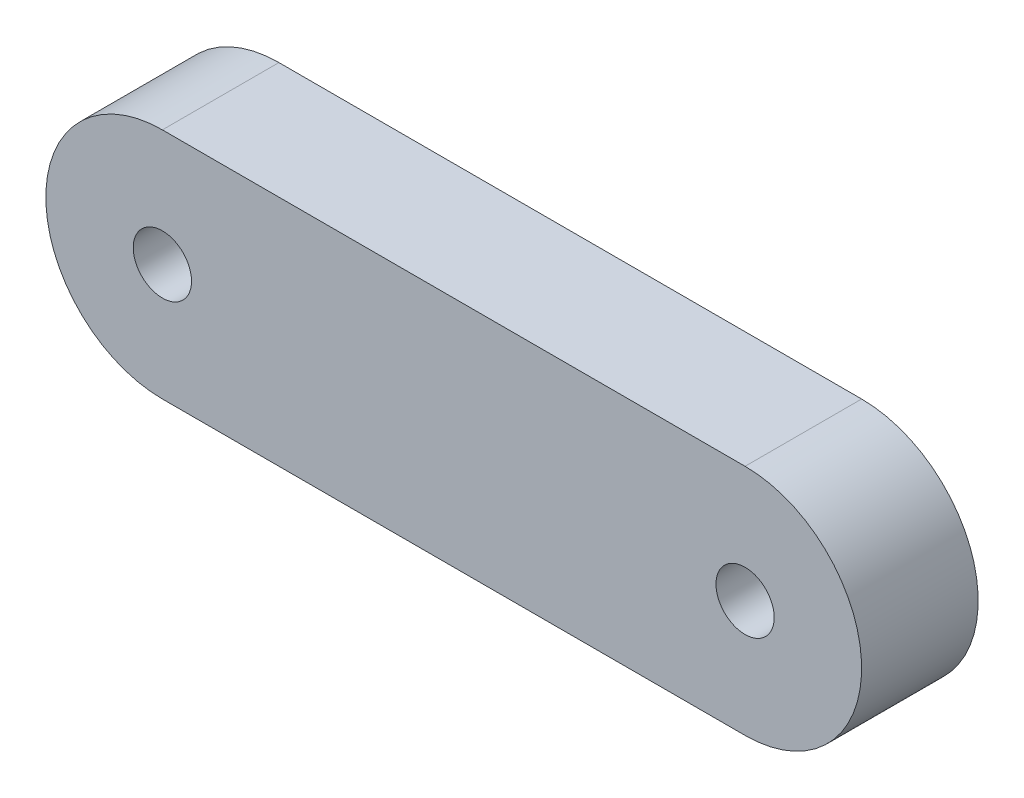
ISO-10303-21;
HEADER;
FILE_DESCRIPTION(('STEP AP214'),'2;1');
FILE_NAME('part.step','',(''),(''),'','','');
FILE_SCHEMA(('AUTOMOTIVE_DESIGN { 1 0 10303 214 1 1 1 1 }'));
ENDSEC;
DATA;
#1=APPLICATION_CONTEXT('core data for automotive mechanical design processes');
#2=APPLICATION_PROTOCOL_DEFINITION('international standard','automotive_design',2000,#1);
#3=PRODUCT_CONTEXT('',#1,'mechanical');
#4=PRODUCT('Part','Part','',(#3));
#5=PRODUCT_RELATED_PRODUCT_CATEGORY('part','',(#4));
#6=PRODUCT_DEFINITION_FORMATION('','',#4);
#7=PRODUCT_DEFINITION_CONTEXT('part definition',#1,'design');
#8=PRODUCT_DEFINITION('design','',#6,#7);
#9=PRODUCT_DEFINITION_SHAPE('','',#8);
#10=(LENGTH_UNIT() NAMED_UNIT(*) SI_UNIT(.MILLI.,.METRE.));
#11=(NAMED_UNIT(*) PLANE_ANGLE_UNIT() SI_UNIT($,.RADIAN.));
#12=(NAMED_UNIT(*) SI_UNIT($,.STERADIAN.) SOLID_ANGLE_UNIT());
#13=UNCERTAINTY_MEASURE_WITH_UNIT(LENGTH_MEASURE(1.E-05),#10,'distance_accuracy_value','');
#14=(GEOMETRIC_REPRESENTATION_CONTEXT(3) GLOBAL_UNCERTAINTY_ASSIGNED_CONTEXT((#13)) GLOBAL_UNIT_ASSIGNED_CONTEXT((#10,
#11,#12)) REPRESENTATION_CONTEXT('',''));
#15=CARTESIAN_POINT('',(0.,0.,0.));
#16=DIRECTION('',(0.,0.,1.));
#17=DIRECTION('',(1.,0.,0.));
#18=AXIS2_PLACEMENT_3D('',#15,#16,#17);
#19=CARTESIAN_POINT('',(0.,0.,2.54));
#20=DIRECTION('',(0.,0.,-1.));
#21=DIRECTION('',(-1.,0.,0.));
#22=AXIS2_PLACEMENT_3D('',#19,#20,#21);
#23=CYLINDRICAL_SURFACE('',#22,2.54);
#24=CARTESIAN_POINT('',(0.,0.,0.));
#25=DIRECTION('',(0.,0.,1.));
#26=DIRECTION('',(1.,0.,0.));
#27=AXIS2_PLACEMENT_3D('',#24,#25,#26);
#28=CIRCLE('',#27,2.54);
#29=CARTESIAN_POINT('',(0.,2.54,0.));
#30=VERTEX_POINT('',#29);
#31=CARTESIAN_POINT('',(0.,-2.54,0.));
#32=VERTEX_POINT('',#31);
#33=EDGE_CURVE('E95',#30,#32,#28,.T.);
#34=ORIENTED_EDGE('',*,*,#33,.T.);
#35=DIRECTION('',(0.,0.,-1.));
#36=VECTOR('',#35,1.);
#37=CARTESIAN_POINT('',(0.,-2.54,2.54));
#38=LINE('',#37,#36);
#39=CARTESIAN_POINT('',(0.,-2.54,2.54));
#40=VERTEX_POINT('',#39);
#41=EDGE_CURVE('E11',#40,#32,#38,.T.);
#42=ORIENTED_EDGE('',*,*,#41,.F.);
#43=CARTESIAN_POINT('',(0.,0.,2.54));
#44=DIRECTION('',(0.,0.,1.));
#45=DIRECTION('',(1.,0.,0.));
#46=AXIS2_PLACEMENT_3D('',#43,#44,#45);
#47=CIRCLE('',#46,2.54);
#48=CARTESIAN_POINT('',(0.,2.54,2.54));
#49=VERTEX_POINT('',#48);
#50=EDGE_CURVE('E83',#49,#40,#47,.T.);
#51=ORIENTED_EDGE('',*,*,#50,.F.);
#52=DIRECTION('',(0.,0.,-1.));
#53=VECTOR('',#52,1.);
#54=CARTESIAN_POINT('',(0.,2.54,2.54));
#55=LINE('',#54,#53);
#56=EDGE_CURVE('E91',#49,#30,#55,.T.);
#57=ORIENTED_EDGE('',*,*,#56,.T.);
#58=EDGE_LOOP('',(#34,#42,#51,#57));
#59=FACE_BOUND('',#58,.T.);
#60=ADVANCED_FACE('F32',(#59),#23,.T.);
#61=CARTESIAN_POINT('',(0.,-2.54,2.54));
#62=DIRECTION('',(0.,1.,0.));
#63=DIRECTION('',(0.,0.,1.));
#64=AXIS2_PLACEMENT_3D('',#61,#62,#63);
#65=PLANE('',#64);
#66=DIRECTION('',(1.,0.,0.));
#67=VECTOR('',#66,1.);
#68=CARTESIAN_POINT('',(0.,-2.54,0.));
#69=LINE('',#68,#67);
#70=CARTESIAN_POINT('',(12.7,-2.54,0.));
#71=VERTEX_POINT('',#70);
#72=EDGE_CURVE('E87',#32,#71,#69,.T.);
#73=ORIENTED_EDGE('',*,*,#72,.T.);
#74=DIRECTION('',(0.,0.,-1.));
#75=VECTOR('',#74,1.);
#76=CARTESIAN_POINT('',(12.7,-2.54,2.54));
#77=LINE('',#76,#75);
#78=CARTESIAN_POINT('',(12.7,-2.54,2.54));
#79=VERTEX_POINT('',#78);
#80=EDGE_CURVE('E40',#79,#71,#77,.T.);
#81=ORIENTED_EDGE('',*,*,#80,.F.);
#82=DIRECTION('',(1.,0.,0.));
#83=VECTOR('',#82,1.);
#84=CARTESIAN_POINT('',(0.,-2.54,2.54));
#85=LINE('',#84,#83);
#86=EDGE_CURVE('E78',#40,#79,#85,.T.);
#87=ORIENTED_EDGE('',*,*,#86,.F.);
#88=ORIENTED_EDGE('',*,*,#41,.T.);
#89=EDGE_LOOP('',(#73,#81,#87,#88));
#90=FACE_BOUND('',#89,.T.);
#91=ADVANCED_FACE('F86',(#90),#65,.F.);
#92=CARTESIAN_POINT('',(12.7,0.,2.54));
#93=DIRECTION('',(0.,0.,-1.));
#94=DIRECTION('',(-1.,0.,0.));
#95=AXIS2_PLACEMENT_3D('',#92,#93,#94);
#96=CYLINDRICAL_SURFACE('',#95,2.54);
#97=CARTESIAN_POINT('',(12.7,0.,0.));
#98=DIRECTION('',(0.,0.,1.));
#99=DIRECTION('',(1.,0.,0.));
#100=AXIS2_PLACEMENT_3D('',#97,#98,#99);
#101=CIRCLE('',#100,2.54);
#102=CARTESIAN_POINT('',(12.7,2.54,0.));
#103=VERTEX_POINT('',#102);
#104=EDGE_CURVE('E65',#71,#103,#101,.T.);
#105=ORIENTED_EDGE('',*,*,#104,.T.);
#106=DIRECTION('',(0.,0.,-1.));
#107=VECTOR('',#106,1.);
#108=CARTESIAN_POINT('',(12.7,2.54,2.54));
#109=LINE('',#108,#107);
#110=CARTESIAN_POINT('',(12.7,2.54,2.54));
#111=VERTEX_POINT('',#110);
#112=EDGE_CURVE('E88',#111,#103,#109,.T.);
#113=ORIENTED_EDGE('',*,*,#112,.F.);
#114=CARTESIAN_POINT('',(12.7,0.,2.54));
#115=DIRECTION('',(0.,0.,1.));
#116=DIRECTION('',(1.,0.,0.));
#117=AXIS2_PLACEMENT_3D('',#114,#115,#116);
#118=CIRCLE('',#117,2.54);
#119=EDGE_CURVE('E81',#79,#111,#118,.T.);
#120=ORIENTED_EDGE('',*,*,#119,.F.);
#121=ORIENTED_EDGE('',*,*,#80,.T.);
#122=EDGE_LOOP('',(#105,#113,#120,#121));
#123=FACE_BOUND('',#122,.T.);
#124=ADVANCED_FACE('F89',(#123),#96,.T.);
#125=CARTESIAN_POINT('',(0.,2.54,2.54));
#126=DIRECTION('',(0.,-1.,0.));
#127=DIRECTION('',(0.,0.,-1.));
#128=AXIS2_PLACEMENT_3D('',#125,#126,#127);
#129=PLANE('',#128);
#130=DIRECTION('',(-1.,0.,0.));
#131=VECTOR('',#130,1.);
#132=CARTESIAN_POINT('',(0.,2.54,0.));
#133=LINE('',#132,#131);
#134=EDGE_CURVE('E71',#103,#30,#133,.T.);
#135=ORIENTED_EDGE('',*,*,#134,.T.);
#136=ORIENTED_EDGE('',*,*,#56,.F.);
#137=DIRECTION('',(-1.,0.,0.));
#138=VECTOR('',#137,1.);
#139=CARTESIAN_POINT('',(0.,2.54,2.54));
#140=LINE('',#139,#138);
#141=EDGE_CURVE('E48',#111,#49,#140,.T.);
#142=ORIENTED_EDGE('',*,*,#141,.F.);
#143=ORIENTED_EDGE('',*,*,#112,.T.);
#144=EDGE_LOOP('',(#135,#136,#142,#143));
#145=FACE_BOUND('',#144,.T.);
#146=ADVANCED_FACE('F103',(#145),#129,.F.);
#147=CARTESIAN_POINT('',(0.,0.,2.54));
#148=DIRECTION('',(0.,0.,1.));
#149=DIRECTION('',(1.,0.,0.));
#150=AXIS2_PLACEMENT_3D('',#147,#148,#149);
#151=PLANE('',#150);
#152=CARTESIAN_POINT('',(12.7,0.,2.54));
#153=DIRECTION('',(0.,0.,1.));
#154=DIRECTION('',(1.,0.,0.));
#155=AXIS2_PLACEMENT_3D('',#152,#153,#154);
#156=CIRCLE('',#155,0.635);
#157=CARTESIAN_POINT('',(13.335,0.,2.54));
#158=VERTEX_POINT('',#157);
#159=EDGE_CURVE('E114',#158,#158,#156,.F.);
#160=ORIENTED_EDGE('',*,*,#159,.T.);
#161=EDGE_LOOP('',(#160));
#162=FACE_BOUND('',#161,.T.);
#163=CARTESIAN_POINT('',(0.,0.,2.54));
#164=DIRECTION('',(0.,0.,1.));
#165=DIRECTION('',(1.,0.,0.));
#166=AXIS2_PLACEMENT_3D('',#163,#164,#165);
#167=CIRCLE('',#166,0.635);
#168=CARTESIAN_POINT('',(0.635,0.,2.54));
#169=VERTEX_POINT('',#168);
#170=EDGE_CURVE('E98',#169,#169,#167,.T.);
#171=ORIENTED_EDGE('',*,*,#170,.F.);
#172=EDGE_LOOP('',(#171));
#173=FACE_BOUND('',#172,.T.);
#174=ORIENTED_EDGE('',*,*,#50,.T.);
#175=ORIENTED_EDGE('',*,*,#86,.T.);
#176=ORIENTED_EDGE('',*,*,#119,.T.);
#177=ORIENTED_EDGE('',*,*,#141,.T.);
#178=EDGE_LOOP('',(#174,#175,#176,#177));
#179=FACE_BOUND('',#178,.T.);
#180=ADVANCED_FACE('F79',(#162,#173,#179),#151,.T.);
#181=CARTESIAN_POINT('',(0.,0.,0.));
#182=DIRECTION('',(0.,0.,1.));
#183=DIRECTION('',(1.,0.,0.));
#184=AXIS2_PLACEMENT_3D('',#181,#182,#183);
#185=PLANE('',#184);
#186=CARTESIAN_POINT('',(12.7,0.,0.));
#187=DIRECTION('',(0.,0.,-1.));
#188=DIRECTION('',(-1.,0.,0.));
#189=AXIS2_PLACEMENT_3D('',#186,#187,#188);
#190=CIRCLE('',#189,0.635);
#191=CARTESIAN_POINT('',(12.065,0.,0.));
#192=VERTEX_POINT('',#191);
#193=EDGE_CURVE('E117',#192,#192,#190,.T.);
#194=ORIENTED_EDGE('',*,*,#193,.F.);
#195=EDGE_LOOP('',(#194));
#196=FACE_BOUND('',#195,.T.);
#197=CARTESIAN_POINT('',(0.,0.,0.));
#198=DIRECTION('',(0.,0.,1.));
#199=DIRECTION('',(1.,0.,0.));
#200=AXIS2_PLACEMENT_3D('',#197,#198,#199);
#201=CIRCLE('',#200,0.635);
#202=CARTESIAN_POINT('',(0.635,0.,0.));
#203=VERTEX_POINT('',#202);
#204=EDGE_CURVE('E111',#203,#203,#201,.T.);
#205=ORIENTED_EDGE('',*,*,#204,.T.);
#206=EDGE_LOOP('',(#205));
#207=FACE_BOUND('',#206,.T.);
#208=ORIENTED_EDGE('',*,*,#33,.F.);
#209=ORIENTED_EDGE('',*,*,#134,.F.);
#210=ORIENTED_EDGE('',*,*,#104,.F.);
#211=ORIENTED_EDGE('',*,*,#72,.F.);
#212=EDGE_LOOP('',(#208,#209,#210,#211));
#213=FACE_BOUND('',#212,.T.);
#214=ADVANCED_FACE('F106',(#196,#207,#213),#185,.F.);
#215=CARTESIAN_POINT('',(0.,0.,0.));
#216=DIRECTION('',(0.,0.,1.));
#217=DIRECTION('',(1.,0.,0.));
#218=AXIS2_PLACEMENT_3D('',#215,#216,#217);
#219=CYLINDRICAL_SURFACE('',#218,0.635);
#220=ORIENTED_EDGE('',*,*,#170,.T.);
#221=EDGE_LOOP('',(#220));
#222=FACE_BOUND('',#221,.T.);
#223=ORIENTED_EDGE('',*,*,#204,.F.);
#224=EDGE_LOOP('',(#223));
#225=FACE_BOUND('',#224,.T.);
#226=ADVANCED_FACE('F125',(#222,#225),#219,.F.);
#227=CARTESIAN_POINT('',(12.7,0.,0.));
#228=DIRECTION('',(0.,0.,1.));
#229=DIRECTION('',(1.,0.,0.));
#230=AXIS2_PLACEMENT_3D('',#227,#228,#229);
#231=CYLINDRICAL_SURFACE('',#230,0.635);
#232=ORIENTED_EDGE('',*,*,#159,.F.);
#233=EDGE_LOOP('',(#232));
#234=FACE_BOUND('',#233,.T.);
#235=ORIENTED_EDGE('',*,*,#193,.T.);
#236=EDGE_LOOP('',(#235));
#237=FACE_BOUND('',#236,.T.);
#238=ADVANCED_FACE('F121',(#234,#237),#231,.F.);
#239=CLOSED_SHELL('',(#60,#91,#124,#146,#180,#214,#226,#238));
#240=MANIFOLD_SOLID_BREP('B2',#239);
#241=ADVANCED_BREP_SHAPE_REPRESENTATION('',(#18,#240),#14);
#242=SHAPE_DEFINITION_REPRESENTATION(#9,#241);
ENDSEC;
END-ISO-10303-21;
